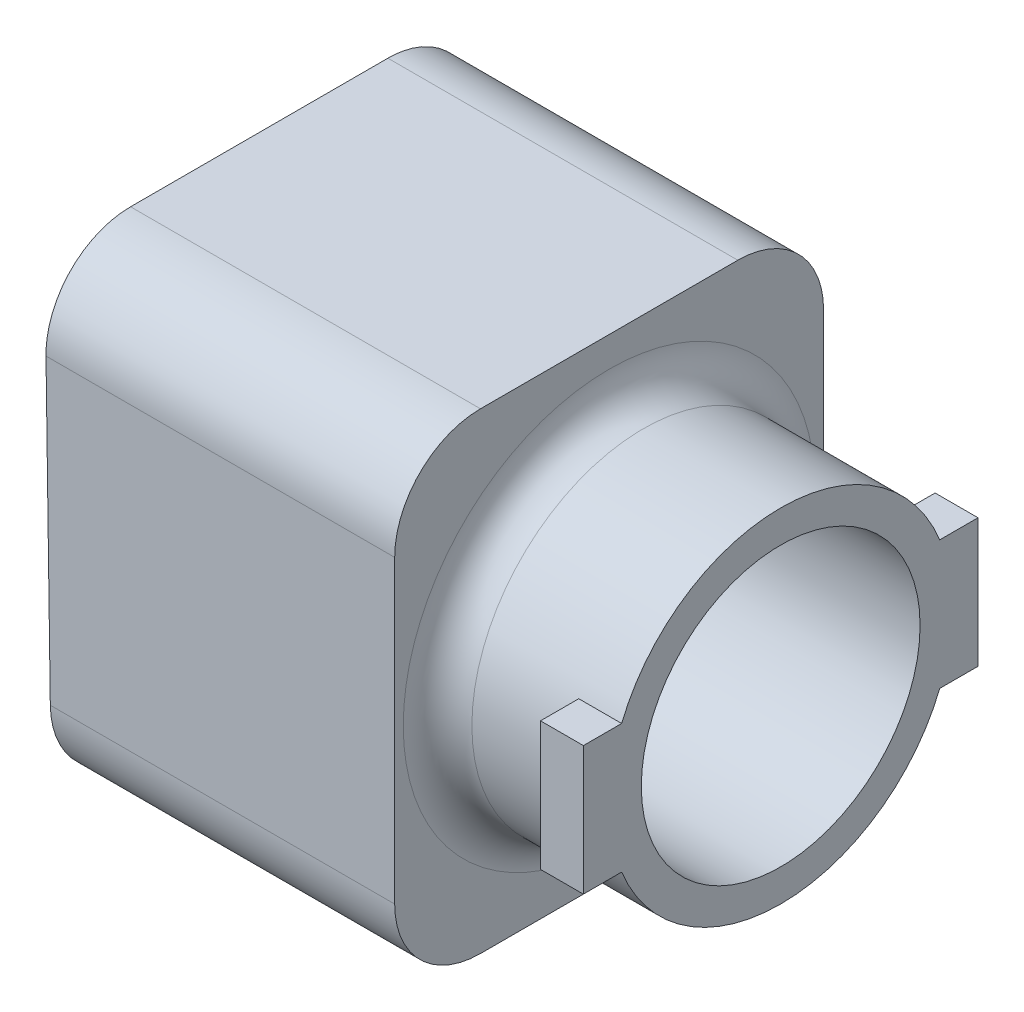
ISO-10303-21;
HEADER;
FILE_DESCRIPTION(('STEP AP214'),'2;1');
FILE_NAME('part.step','',(''),(''),'','','');
FILE_SCHEMA(('AUTOMOTIVE_DESIGN { 1 0 10303 214 1 1 1 1 }'));
ENDSEC;
DATA;
#1=APPLICATION_CONTEXT('core data for automotive mechanical design processes');
#2=APPLICATION_PROTOCOL_DEFINITION('international standard','automotive_design',2000,#1);
#3=PRODUCT_CONTEXT('',#1,'mechanical');
#4=PRODUCT('Part','Part','',(#3));
#5=PRODUCT_RELATED_PRODUCT_CATEGORY('part','',(#4));
#6=PRODUCT_DEFINITION_FORMATION('','',#4);
#7=PRODUCT_DEFINITION_CONTEXT('part definition',#1,'design');
#8=PRODUCT_DEFINITION('design','',#6,#7);
#9=PRODUCT_DEFINITION_SHAPE('','',#8);
#10=(LENGTH_UNIT() NAMED_UNIT(*) SI_UNIT(.MILLI.,.METRE.));
#11=(NAMED_UNIT(*) PLANE_ANGLE_UNIT() SI_UNIT($,.RADIAN.));
#12=(NAMED_UNIT(*) SI_UNIT($,.STERADIAN.) SOLID_ANGLE_UNIT());
#13=UNCERTAINTY_MEASURE_WITH_UNIT(LENGTH_MEASURE(1.E-05),#10,'distance_accuracy_value','');
#14=(GEOMETRIC_REPRESENTATION_CONTEXT(3) GLOBAL_UNCERTAINTY_ASSIGNED_CONTEXT((#13)) GLOBAL_UNIT_ASSIGNED_CONTEXT((#10,
#11,#12)) REPRESENTATION_CONTEXT('',''));
#15=CARTESIAN_POINT('',(0.,0.,0.));
#16=DIRECTION('',(0.,0.,1.));
#17=DIRECTION('',(1.,0.,0.));
#18=AXIS2_PLACEMENT_3D('',#15,#16,#17);
#19=CARTESIAN_POINT('',(93.696802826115,20.3973537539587,19.05));
#20=DIRECTION('',(0.0143574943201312,-0.999896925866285,0.));
#21=DIRECTION('',(0.999896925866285,0.0143574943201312,0.));
#22=AXIS2_PLACEMENT_3D('',#19,#20,#21);
#23=PLANE('',#22);
#24=DIRECTION('',(0.,0.,1.));
#25=VECTOR('',#24,1.);
#26=CARTESIAN_POINT('',(-0.2735102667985,19.0480364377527,19.05));
#27=LINE('',#26,#25);
#28=CARTESIAN_POINT('',(-0.2735102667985,19.0480364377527,44.45));
#29=VERTEX_POINT('',#28);
#30=CARTESIAN_POINT('',(-0.2735102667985,19.0480364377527,82.55));
#31=VERTEX_POINT('',#30);
#32=EDGE_CURVE('E328',#29,#31,#27,.T.);
#33=ORIENTED_EDGE('',*,*,#32,.T.);
#34=DIRECTION('',(-0.999896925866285,-0.0143574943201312,0.));
#35=VECTOR('',#34,1.);
#36=CARTESIAN_POINT('',(93.696802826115,20.3973537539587,82.55));
#37=LINE('',#36,#35);
#38=CARTESIAN_POINT('',(50.8,19.7813996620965,82.55));
#39=VERTEX_POINT('',#38);
#40=EDGE_CURVE('E438',#31,#39,#37,.F.);
#41=ORIENTED_EDGE('',*,*,#40,.T.);
#42=CARTESIAN_POINT('',(50.8,19.7813996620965,63.5));
#43=DIRECTION('',(0.0143574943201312,-0.999896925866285,0.));
#44=DIRECTION('',(-0.999896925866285,-0.0143574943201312,0.));
#45=AXIS2_PLACEMENT_3D('',#42,#43,#44);
#46=ELLIPSE('',#45,19.0519637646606,19.05);
#47=CARTESIAN_POINT('',(50.8,19.7813996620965,44.45));
#48=VERTEX_POINT('',#47);
#49=EDGE_CURVE('E292',#39,#48,#46,.T.);
#50=ORIENTED_EDGE('',*,*,#49,.T.);
#51=DIRECTION('',(-0.999896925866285,-0.0143574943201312,0.));
#52=VECTOR('',#51,1.);
#53=CARTESIAN_POINT('',(-0.273510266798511,19.0480364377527,44.45));
#54=LINE('',#53,#52);
#55=EDGE_CURVE('E428',#48,#29,#54,.T.);
#56=ORIENTED_EDGE('',*,*,#55,.T.);
#57=EDGE_LOOP('',(#33,#41,#50,#56));
#58=FACE_BOUND('',#57,.T.);
#59=ADVANCED_FACE('F41',(#58),#23,.F.);
#60=CARTESIAN_POINT('',(-2.18830769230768,152.4,127.));
#61=DIRECTION('',(0.999896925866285,0.0143574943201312,0.));
#62=DIRECTION('',(-0.0143574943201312,0.999896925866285,0.));
#63=AXIS2_PLACEMENT_3D('',#60,#61,#62);
#64=PLANE('',#63);
#65=ORIENTED_EDGE('',*,*,#32,.F.);
#66=CARTESIAN_POINT('',(-0.638190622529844,44.4454183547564,44.45));
#67=DIRECTION('',(0.999896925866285,0.0143574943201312,0.));
#68=DIRECTION('',(-0.0143574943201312,0.999896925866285,0.));
#69=AXIS2_PLACEMENT_3D('',#66,#67,#68);
#70=CIRCLE('',#69,25.4);
#71=CARTESIAN_POINT('',(-0.638190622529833,44.4454183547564,19.05));
#72=VERTEX_POINT('',#71);
#73=EDGE_CURVE('E476',#29,#72,#70,.T.);
#74=ORIENTED_EDGE('',*,*,#73,.T.);
#75=DIRECTION('',(0.0143574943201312,-0.999896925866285,0.));
#76=VECTOR('',#75,1.);
#77=CARTESIAN_POINT('',(-1.73223168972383,120.637564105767,19.05));
#78=LINE('',#77,#76);
#79=CARTESIAN_POINT('',(-1.3675513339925,95.2401821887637,19.05));
#80=VERTEX_POINT('',#79);
#81=EDGE_CURVE('E306',#80,#72,#78,.T.);
#82=ORIENTED_EDGE('',*,*,#81,.F.);
#83=CARTESIAN_POINT('',(-1.36755133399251,95.2401821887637,44.45));
#84=DIRECTION('',(0.999896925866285,0.0143574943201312,0.));
#85=DIRECTION('',(-0.0143574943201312,0.999896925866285,0.));
#86=AXIS2_PLACEMENT_3D('',#83,#84,#85);
#87=CIRCLE('',#86,25.4);
#88=CARTESIAN_POINT('',(-1.73223168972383,120.637564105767,44.45));
#89=VERTEX_POINT('',#88);
#90=EDGE_CURVE('E473',#80,#89,#87,.T.);
#91=ORIENTED_EDGE('',*,*,#90,.T.);
#92=DIRECTION('',(0.,0.,-1.));
#93=VECTOR('',#92,1.);
#94=CARTESIAN_POINT('',(-1.73223168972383,120.637564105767,19.05));
#95=LINE('',#94,#93);
#96=CARTESIAN_POINT('',(-1.73223168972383,120.637564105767,82.55));
#97=VERTEX_POINT('',#96);
#98=EDGE_CURVE('E312',#97,#89,#95,.T.);
#99=ORIENTED_EDGE('',*,*,#98,.F.);
#100=CARTESIAN_POINT('',(-1.36755133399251,95.2401821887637,82.55));
#101=DIRECTION('',(0.999896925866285,0.0143574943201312,0.));
#102=DIRECTION('',(-0.0143574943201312,0.999896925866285,0.));
#103=AXIS2_PLACEMENT_3D('',#100,#101,#102);
#104=CIRCLE('',#103,25.4);
#105=CARTESIAN_POINT('',(-1.3675513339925,95.2401821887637,107.95));
#106=VERTEX_POINT('',#105);
#107=EDGE_CURVE('E470',#97,#106,#104,.T.);
#108=ORIENTED_EDGE('',*,*,#107,.T.);
#109=DIRECTION('',(-0.0143574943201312,0.999896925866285,0.));
#110=VECTOR('',#109,1.);
#111=CARTESIAN_POINT('',(-1.73223168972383,120.637564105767,107.95));
#112=LINE('',#111,#110);
#113=CARTESIAN_POINT('',(-0.638190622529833,44.4454183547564,107.95));
#114=VERTEX_POINT('',#113);
#115=EDGE_CURVE('E332',#114,#106,#112,.T.);
#116=ORIENTED_EDGE('',*,*,#115,.F.);
#117=CARTESIAN_POINT('',(-0.638190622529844,44.4454183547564,82.55));
#118=DIRECTION('',(0.999896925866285,0.0143574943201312,0.));
#119=DIRECTION('',(-0.0143574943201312,0.999896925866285,0.));
#120=AXIS2_PLACEMENT_3D('',#117,#118,#119);
#121=CIRCLE('',#120,25.4);
#122=EDGE_CURVE('E467',#114,#31,#121,.T.);
#123=ORIENTED_EDGE('',*,*,#122,.T.);
#124=EDGE_LOOP('',(#65,#74,#82,#91,#99,#108,#116,#123));
#125=FACE_BOUND('',#124,.T.);
#126=DIRECTION('',(0.0143574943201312,-0.999896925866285,0.));
#127=VECTOR('',#126,1.);
#128=CARTESIAN_POINT('',(-2.18830769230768,152.4,0.));
#129=LINE('',#128,#127);
#130=CARTESIAN_POINT('',(-1.64123076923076,114.3,0.));
#131=VERTEX_POINT('',#130);
#132=CARTESIAN_POINT('',(-0.364717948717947,25.4,0.));
#133=VERTEX_POINT('',#132);
#134=EDGE_CURVE('E324',#131,#133,#129,.T.);
#135=ORIENTED_EDGE('',*,*,#134,.T.);
#136=CARTESIAN_POINT('',(-0.364717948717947,25.4,25.4));
#137=DIRECTION('',(0.999896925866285,0.0143574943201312,0.));
#138=DIRECTION('',(0.0143574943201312,-0.999896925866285,0.));
#139=AXIS2_PLACEMENT_3D('',#136,#137,#138);
#140=ELLIPSE('',#139,25.4026183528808,25.4);
#141=CARTESIAN_POINT('',(0.,0.,25.4));
#142=VERTEX_POINT('',#141);
#143=EDGE_CURVE('E404',#133,#142,#140,.F.);
#144=ORIENTED_EDGE('',*,*,#143,.T.);
#145=DIRECTION('',(0.,0.,-1.));
#146=VECTOR('',#145,1.);
#147=CARTESIAN_POINT('',(0.,0.,127.));
#148=LINE('',#147,#146);
#149=CARTESIAN_POINT('',(0.,0.,101.6));
#150=VERTEX_POINT('',#149);
#151=EDGE_CURVE('E362',#150,#142,#148,.T.);
#152=ORIENTED_EDGE('',*,*,#151,.F.);
#153=CARTESIAN_POINT('',(-0.364717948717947,25.4,101.6));
#154=DIRECTION('',(0.999896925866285,0.0143574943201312,0.));
#155=DIRECTION('',(-0.0143574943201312,0.999896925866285,0.));
#156=AXIS2_PLACEMENT_3D('',#153,#154,#155);
#157=ELLIPSE('',#156,25.4026183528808,25.4);
#158=CARTESIAN_POINT('',(-0.364717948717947,25.4,127.));
#159=VERTEX_POINT('',#158);
#160=EDGE_CURVE('E401',#150,#159,#157,.F.);
#161=ORIENTED_EDGE('',*,*,#160,.T.);
#162=DIRECTION('',(0.0143574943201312,-0.999896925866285,0.));
#163=VECTOR('',#162,1.);
#164=CARTESIAN_POINT('',(-2.18830769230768,152.4,127.));
#165=LINE('',#164,#163);
#166=CARTESIAN_POINT('',(-1.64123076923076,114.3,127.));
#167=VERTEX_POINT('',#166);
#168=EDGE_CURVE('E339',#167,#159,#165,.T.);
#169=ORIENTED_EDGE('',*,*,#168,.F.);
#170=CARTESIAN_POINT('',(-1.64123076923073,114.3,101.6));
#171=DIRECTION('',(0.999896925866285,0.0143574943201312,0.));
#172=DIRECTION('',(-0.0143574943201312,0.999896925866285,0.));
#173=AXIS2_PLACEMENT_3D('',#170,#171,#172);
#174=ELLIPSE('',#173,25.4026183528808,25.4);
#175=CARTESIAN_POINT('',(-2.00594871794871,139.7,101.6));
#176=VERTEX_POINT('',#175);
#177=EDGE_CURVE('E398',#167,#176,#174,.F.);
#178=ORIENTED_EDGE('',*,*,#177,.T.);
#179=DIRECTION('',(0.,0.,-1.));
#180=VECTOR('',#179,1.);
#181=CARTESIAN_POINT('',(-2.00594871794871,139.7,127.));
#182=LINE('',#181,#180);
#183=CARTESIAN_POINT('',(-2.00594871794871,139.7,25.4));
#184=VERTEX_POINT('',#183);
#185=EDGE_CURVE('E297',#176,#184,#182,.T.);
#186=ORIENTED_EDGE('',*,*,#185,.T.);
#187=CARTESIAN_POINT('',(-1.64123076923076,114.3,25.4));
#188=DIRECTION('',(0.999896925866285,0.0143574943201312,0.));
#189=DIRECTION('',(0.0143574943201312,-0.999896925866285,0.));
#190=AXIS2_PLACEMENT_3D('',#187,#188,#189);
#191=ELLIPSE('',#190,25.4026183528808,25.4);
#192=EDGE_CURVE('E395',#184,#131,#191,.F.);
#193=ORIENTED_EDGE('',*,*,#192,.T.);
#194=EDGE_LOOP('',(#135,#144,#152,#161,#169,#178,#186,#193));
#195=FACE_BOUND('',#194,.T.);
#196=ADVANCED_FACE('F520',(#125,#195),#64,.F.);
#197=CARTESIAN_POINT('',(0.,0.,127.));
#198=DIRECTION('',(0.,1.,0.));
#199=DIRECTION('',(0.,0.,1.));
#200=AXIS2_PLACEMENT_3D('',#197,#198,#199);
#201=PLANE('',#200);
#202=CARTESIAN_POINT('',(50.8,0.,63.5));
#203=DIRECTION('',(0.,-1.,0.));
#204=DIRECTION('',(0.,0.,-1.));
#205=AXIS2_PLACEMENT_3D('',#202,#203,#204);
#206=CIRCLE('',#205,25.4);
#207=CARTESIAN_POINT('',(50.8,0.,38.1));
#208=VERTEX_POINT('',#207);
#209=EDGE_CURVE('E298',#208,#208,#206,.T.);
#210=ORIENTED_EDGE('',*,*,#209,.F.);
#211=EDGE_LOOP('',(#210));
#212=FACE_BOUND('',#211,.T.);
#213=ORIENTED_EDGE('',*,*,#151,.T.);
#214=DIRECTION('',(1.,0.,0.));
#215=VECTOR('',#214,1.);
#216=CARTESIAN_POINT('',(0.,0.,25.4));
#217=LINE('',#216,#215);
#218=CARTESIAN_POINT('',(101.6,0.,25.4));
#219=VERTEX_POINT('',#218);
#220=EDGE_CURVE('E372',#142,#219,#217,.T.);
#221=ORIENTED_EDGE('',*,*,#220,.T.);
#222=DIRECTION('',(0.,0.,-1.));
#223=VECTOR('',#222,1.);
#224=CARTESIAN_POINT('',(101.6,0.,127.));
#225=LINE('',#224,#223);
#226=CARTESIAN_POINT('',(101.6,0.,101.6));
#227=VERTEX_POINT('',#226);
#228=EDGE_CURVE('E358',#227,#219,#225,.T.);
#229=ORIENTED_EDGE('',*,*,#228,.F.);
#230=DIRECTION('',(1.,0.,0.));
#231=VECTOR('',#230,1.);
#232=CARTESIAN_POINT('',(0.,0.,101.6));
#233=LINE('',#232,#231);
#234=EDGE_CURVE('E366',#227,#150,#233,.F.);
#235=ORIENTED_EDGE('',*,*,#234,.T.);
#236=EDGE_LOOP('',(#213,#221,#229,#235));
#237=FACE_BOUND('',#236,.T.);
#238=ADVANCED_FACE('F527',(#212,#237),#201,.F.);
#239=CARTESIAN_POINT('',(101.6,0.,127.));
#240=DIRECTION('',(-1.,0.,0.));
#241=DIRECTION('',(0.,0.,1.));
#242=AXIS2_PLACEMENT_3D('',#239,#240,#241);
#243=PLANE('',#242);
#244=CARTESIAN_POINT('',(101.6,69.85,63.5));
#245=DIRECTION('',(-1.,0.,0.));
#246=DIRECTION('',(0.,0.,1.));
#247=AXIS2_PLACEMENT_3D('',#244,#245,#246);
#248=CIRCLE('',#247,60.96);
#249=CARTESIAN_POINT('',(101.6,69.85,124.46));
#250=VERTEX_POINT('',#249);
#251=EDGE_CURVE('E482',#250,#250,#248,.T.);
#252=ORIENTED_EDGE('',*,*,#251,.T.);
#253=EDGE_LOOP('',(#252));
#254=FACE_BOUND('',#253,.T.);
#255=ORIENTED_EDGE('',*,*,#228,.T.);
#256=CARTESIAN_POINT('',(101.6,25.4,25.4));
#257=DIRECTION('',(-1.,0.,0.));
#258=DIRECTION('',(0.,0.,1.));
#259=AXIS2_PLACEMENT_3D('',#256,#257,#258);
#260=CIRCLE('',#259,25.4);
#261=CARTESIAN_POINT('',(101.6,25.4,0.));
#262=VERTEX_POINT('',#261);
#263=EDGE_CURVE('E385',#219,#262,#260,.F.);
#264=ORIENTED_EDGE('',*,*,#263,.T.);
#265=DIRECTION('',(0.,1.,0.));
#266=VECTOR('',#265,1.);
#267=CARTESIAN_POINT('',(101.6,0.,0.));
#268=LINE('',#267,#266);
#269=CARTESIAN_POINT('',(101.6,114.3,0.));
#270=VERTEX_POINT('',#269);
#271=EDGE_CURVE('E344',#262,#270,#268,.T.);
#272=ORIENTED_EDGE('',*,*,#271,.T.);
#273=CARTESIAN_POINT('',(101.6,114.3,25.4));
#274=DIRECTION('',(-1.,0.,0.));
#275=DIRECTION('',(0.,0.,1.));
#276=AXIS2_PLACEMENT_3D('',#273,#274,#275);
#277=CIRCLE('',#276,25.4);
#278=CARTESIAN_POINT('',(101.6,139.7,25.4));
#279=VERTEX_POINT('',#278);
#280=EDGE_CURVE('E376',#270,#279,#277,.F.);
#281=ORIENTED_EDGE('',*,*,#280,.T.);
#282=DIRECTION('',(0.,0.,-1.));
#283=VECTOR('',#282,1.);
#284=CARTESIAN_POINT('',(101.6,139.7,127.));
#285=LINE('',#284,#283);
#286=CARTESIAN_POINT('',(101.6,139.7,101.6));
#287=VERTEX_POINT('',#286);
#288=EDGE_CURVE('E348',#287,#279,#285,.T.);
#289=ORIENTED_EDGE('',*,*,#288,.F.);
#290=CARTESIAN_POINT('',(101.6,114.3,101.6));
#291=DIRECTION('',(-1.,0.,0.));
#292=DIRECTION('',(0.,0.,1.));
#293=AXIS2_PLACEMENT_3D('',#290,#291,#292);
#294=CIRCLE('',#293,25.4);
#295=CARTESIAN_POINT('',(101.6,114.3,127.));
#296=VERTEX_POINT('',#295);
#297=EDGE_CURVE('E379',#287,#296,#294,.F.);
#298=ORIENTED_EDGE('',*,*,#297,.T.);
#299=DIRECTION('',(0.,1.,0.));
#300=VECTOR('',#299,1.);
#301=CARTESIAN_POINT('',(101.6,0.,127.));
#302=LINE('',#301,#300);
#303=CARTESIAN_POINT('',(101.6,25.4,127.));
#304=VERTEX_POINT('',#303);
#305=EDGE_CURVE('E343',#304,#296,#302,.T.);
#306=ORIENTED_EDGE('',*,*,#305,.F.);
#307=CARTESIAN_POINT('',(101.6,25.4,101.6));
#308=DIRECTION('',(-1.,0.,0.));
#309=DIRECTION('',(0.,0.,1.));
#310=AXIS2_PLACEMENT_3D('',#307,#308,#309);
#311=CIRCLE('',#310,25.4);
#312=EDGE_CURVE('E382',#304,#227,#311,.F.);
#313=ORIENTED_EDGE('',*,*,#312,.T.);
#314=EDGE_LOOP('',(#255,#264,#272,#281,#289,#298,#306,#313));
#315=FACE_BOUND('',#314,.T.);
#316=ADVANCED_FACE('F598',(#254,#315),#243,.F.);
#317=CARTESIAN_POINT('',(0.,0.,127.));
#318=DIRECTION('',(0.,0.,1.));
#319=DIRECTION('',(1.,0.,0.));
#320=AXIS2_PLACEMENT_3D('',#317,#318,#319);
#321=PLANE('',#320);
#322=ORIENTED_EDGE('',*,*,#168,.T.);
#323=DIRECTION('',(1.,0.,0.));
#324=VECTOR('',#323,1.);
#325=CARTESIAN_POINT('',(101.6,25.4,127.));
#326=LINE('',#325,#324);
#327=EDGE_CURVE('E410',#159,#304,#326,.T.);
#328=ORIENTED_EDGE('',*,*,#327,.T.);
#329=ORIENTED_EDGE('',*,*,#305,.T.);
#330=DIRECTION('',(1.,0.,0.));
#331=VECTOR('',#330,1.);
#332=CARTESIAN_POINT('',(-2.00594871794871,114.3,127.));
#333=LINE('',#332,#331);
#334=EDGE_CURVE('E407',#296,#167,#333,.F.);
#335=ORIENTED_EDGE('',*,*,#334,.T.);
#336=EDGE_LOOP('',(#322,#328,#329,#335));
#337=FACE_BOUND('',#336,.T.);
#338=ADVANCED_FACE('F606',(#337),#321,.T.);
#339=CARTESIAN_POINT('',(0.,0.,0.));
#340=DIRECTION('',(0.,0.,1.));
#341=DIRECTION('',(1.,0.,0.));
#342=AXIS2_PLACEMENT_3D('',#339,#340,#341);
#343=PLANE('',#342);
#344=ORIENTED_EDGE('',*,*,#271,.F.);
#345=DIRECTION('',(1.,0.,0.));
#346=VECTOR('',#345,1.);
#347=CARTESIAN_POINT('',(0.,25.4,0.));
#348=LINE('',#347,#346);
#349=EDGE_CURVE('E392',#262,#133,#348,.F.);
#350=ORIENTED_EDGE('',*,*,#349,.T.);
#351=ORIENTED_EDGE('',*,*,#134,.F.);
#352=DIRECTION('',(1.,0.,0.));
#353=VECTOR('',#352,1.);
#354=CARTESIAN_POINT('',(0.,114.3,0.));
#355=LINE('',#354,#353);
#356=EDGE_CURVE('E388',#131,#270,#355,.T.);
#357=ORIENTED_EDGE('',*,*,#356,.T.);
#358=EDGE_LOOP('',(#344,#350,#351,#357));
#359=FACE_BOUND('',#358,.T.);
#360=ADVANCED_FACE('F619',(#359),#343,.F.);
#361=CARTESIAN_POINT('',(92.2380814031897,121.986881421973,19.05));
#362=DIRECTION('',(0.,0.,-1.));
#363=DIRECTION('',(0.,1.,0.));
#364=AXIS2_PLACEMENT_3D('',#361,#362,#363);
#365=PLANE('',#364);
#366=DIRECTION('',(0.0143574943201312,-0.999896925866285,0.));
#367=VECTOR('',#366,1.);
#368=CARTESIAN_POINT('',(92.2380814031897,121.986881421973,19.05));
#369=LINE('',#368,#367);
#370=CARTESIAN_POINT('',(92.602761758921,96.5894995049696,19.05));
#371=VERTEX_POINT('',#370);
#372=CARTESIAN_POINT('',(93.3321224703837,45.7947356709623,19.05));
#373=VERTEX_POINT('',#372);
#374=EDGE_CURVE('E307',#371,#373,#369,.T.);
#375=ORIENTED_EDGE('',*,*,#374,.F.);
#376=DIRECTION('',(-0.999896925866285,-0.0143574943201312,0.));
#377=VECTOR('',#376,1.);
#378=CARTESIAN_POINT('',(-1.36755133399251,95.2401821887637,19.05));
#379=LINE('',#378,#377);
#380=EDGE_CURVE('E463',#371,#80,#379,.T.);
#381=ORIENTED_EDGE('',*,*,#380,.T.);
#382=ORIENTED_EDGE('',*,*,#81,.T.);
#383=DIRECTION('',(-0.999896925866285,-0.0143574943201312,0.));
#384=VECTOR('',#383,1.);
#385=CARTESIAN_POINT('',(93.3321224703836,45.7947356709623,19.05));
#386=LINE('',#385,#384);
#387=EDGE_CURVE('E460',#72,#373,#386,.F.);
#388=ORIENTED_EDGE('',*,*,#387,.T.);
#389=EDGE_LOOP('',(#375,#381,#382,#388));
#390=FACE_BOUND('',#389,.T.);
#391=ADVANCED_FACE('F576',(#390),#365,.F.);
#392=CARTESIAN_POINT('',(92.2380814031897,121.986881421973,19.05));
#393=DIRECTION('',(-0.0143574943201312,0.999896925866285,0.));
#394=DIRECTION('',(-0.999896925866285,-0.0143574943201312,0.));
#395=AXIS2_PLACEMENT_3D('',#392,#393,#394);
#396=PLANE('',#395);
#397=DIRECTION('',(0.,0.,-1.));
#398=VECTOR('',#397,1.);
#399=CARTESIAN_POINT('',(92.2380814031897,121.986881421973,19.05));
#400=LINE('',#399,#398);
#401=CARTESIAN_POINT('',(92.2380814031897,121.986881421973,82.55));
#402=VERTEX_POINT('',#401);
#403=CARTESIAN_POINT('',(92.2380814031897,121.986881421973,44.45));
#404=VERTEX_POINT('',#403);
#405=EDGE_CURVE('E320',#402,#404,#400,.T.);
#406=ORIENTED_EDGE('',*,*,#405,.F.);
#407=DIRECTION('',(-0.999896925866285,-0.0143574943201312,0.));
#408=VECTOR('',#407,1.);
#409=CARTESIAN_POINT('',(-1.73223168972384,120.637564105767,82.55));
#410=LINE('',#409,#408);
#411=EDGE_CURVE('E456',#402,#97,#410,.T.);
#412=ORIENTED_EDGE('',*,*,#411,.T.);
#413=ORIENTED_EDGE('',*,*,#98,.T.);
#414=DIRECTION('',(-0.999896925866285,-0.0143574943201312,0.));
#415=VECTOR('',#414,1.);
#416=CARTESIAN_POINT('',(92.2380814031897,121.986881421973,44.45));
#417=LINE('',#416,#415);
#418=EDGE_CURVE('E453',#89,#404,#417,.F.);
#419=ORIENTED_EDGE('',*,*,#418,.T.);
#420=EDGE_LOOP('',(#406,#412,#413,#419));
#421=FACE_BOUND('',#420,.T.);
#422=ADVANCED_FACE('F543',(#421),#396,.F.);
#423=CARTESIAN_POINT('',(92.2380814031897,121.986881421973,107.95));
#424=DIRECTION('',(0.,0.,1.));
#425=DIRECTION('',(0.,-1.,0.));
#426=AXIS2_PLACEMENT_3D('',#423,#424,#425);
#427=PLANE('',#426);
#428=DIRECTION('',(-0.0143574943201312,0.999896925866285,0.));
#429=VECTOR('',#428,1.);
#430=CARTESIAN_POINT('',(92.2380814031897,121.986881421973,107.95));
#431=LINE('',#430,#429);
#432=CARTESIAN_POINT('',(93.3321224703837,45.7947356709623,107.95));
#433=VERTEX_POINT('',#432);
#434=CARTESIAN_POINT('',(92.602761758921,96.5894995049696,107.95));
#435=VERTEX_POINT('',#434);
#436=EDGE_CURVE('E316',#433,#435,#431,.T.);
#437=ORIENTED_EDGE('',*,*,#436,.F.);
#438=DIRECTION('',(-0.999896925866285,-0.0143574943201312,0.));
#439=VECTOR('',#438,1.);
#440=CARTESIAN_POINT('',(-0.638190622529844,44.4454183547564,107.95));
#441=LINE('',#440,#439);
#442=EDGE_CURVE('E424',#433,#114,#441,.T.);
#443=ORIENTED_EDGE('',*,*,#442,.T.);
#444=ORIENTED_EDGE('',*,*,#115,.T.);
#445=DIRECTION('',(-0.999896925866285,-0.0143574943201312,0.));
#446=VECTOR('',#445,1.);
#447=CARTESIAN_POINT('',(92.602761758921,96.5894995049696,107.95));
#448=LINE('',#447,#446);
#449=EDGE_CURVE('E421',#106,#435,#448,.F.);
#450=ORIENTED_EDGE('',*,*,#449,.T.);
#451=EDGE_LOOP('',(#437,#443,#444,#450));
#452=FACE_BOUND('',#451,.T.);
#453=ADVANCED_FACE('F534',(#452),#427,.F.);
#454=EDGE_CURVE('E302',#48,#39,#46,.T.);
#455=ORIENTED_EDGE('',*,*,#454,.T.);
#456=DIRECTION('',(-0.999896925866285,-0.0143574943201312,0.));
#457=VECTOR('',#456,1.);
#458=CARTESIAN_POINT('',(93.696802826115,20.3973537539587,82.55));
#459=LINE('',#458,#457);
#460=CARTESIAN_POINT('',(93.696802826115,20.3973537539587,82.55));
#461=VERTEX_POINT('',#460);
#462=EDGE_CURVE('E435',#39,#461,#459,.F.);
#463=ORIENTED_EDGE('',*,*,#462,.T.);
#464=DIRECTION('',(0.,0.,1.));
#465=VECTOR('',#464,1.);
#466=CARTESIAN_POINT('',(93.696802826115,20.3973537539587,19.05));
#467=LINE('',#466,#465);
#468=CARTESIAN_POINT('',(93.696802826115,20.3973537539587,44.45));
#469=VERTEX_POINT('',#468);
#470=EDGE_CURVE('E311',#469,#461,#467,.T.);
#471=ORIENTED_EDGE('',*,*,#470,.F.);
#472=DIRECTION('',(-0.999896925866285,-0.0143574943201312,0.));
#473=VECTOR('',#472,1.);
#474=CARTESIAN_POINT('',(-0.273510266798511,19.0480364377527,44.45));
#475=LINE('',#474,#473);
#476=EDGE_CURVE('E431',#469,#48,#475,.T.);
#477=ORIENTED_EDGE('',*,*,#476,.T.);
#478=EDGE_LOOP('',(#455,#463,#471,#477));
#479=FACE_BOUND('',#478,.T.);
#480=ADVANCED_FACE('F523',(#479),#23,.F.);
#481=CARTESIAN_POINT('',(93.9703130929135,1.34931731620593,0.));
#482=DIRECTION('',(-0.999896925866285,-0.0143574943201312,0.));
#483=DIRECTION('',(0.0143574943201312,-0.999896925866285,0.));
#484=AXIS2_PLACEMENT_3D('',#481,#482,#483);
#485=PLANE('',#484);
#486=CARTESIAN_POINT('',(92.9867135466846,69.85,63.5));
#487=DIRECTION('',(-0.999896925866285,-0.0143574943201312,0.));
#488=DIRECTION('',(0.0143574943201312,-0.999896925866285,0.));
#489=AXIS2_PLACEMENT_3D('',#486,#487,#488);
#490=ELLIPSE('',#489,41.2792548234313,41.275);
#491=CARTESIAN_POINT('',(93.5793802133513,28.575,63.5));
#492=VERTEX_POINT('',#491);
#493=EDGE_CURVE('E242',#492,#492,#490,.T.);
#494=ORIENTED_EDGE('',*,*,#493,.F.);
#495=EDGE_LOOP('',(#494));
#496=FACE_BOUND('',#495,.T.);
#497=ORIENTED_EDGE('',*,*,#470,.T.);
#498=CARTESIAN_POINT('',(93.3321224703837,45.7947356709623,82.55));
#499=DIRECTION('',(-0.999896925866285,-0.0143574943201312,0.));
#500=DIRECTION('',(0.0143574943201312,-0.999896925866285,0.));
#501=AXIS2_PLACEMENT_3D('',#498,#499,#500);
#502=CIRCLE('',#501,25.4);
#503=EDGE_CURVE('E450',#461,#433,#502,.T.);
#504=ORIENTED_EDGE('',*,*,#503,.T.);
#505=ORIENTED_EDGE('',*,*,#436,.T.);
#506=CARTESIAN_POINT('',(92.602761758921,96.5894995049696,82.55));
#507=DIRECTION('',(-0.999896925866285,-0.0143574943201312,0.));
#508=DIRECTION('',(0.0143574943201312,-0.999896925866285,0.));
#509=AXIS2_PLACEMENT_3D('',#506,#507,#508);
#510=CIRCLE('',#509,25.4);
#511=EDGE_CURVE('E447',#435,#402,#510,.T.);
#512=ORIENTED_EDGE('',*,*,#511,.T.);
#513=ORIENTED_EDGE('',*,*,#405,.T.);
#514=CARTESIAN_POINT('',(92.602761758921,96.5894995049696,44.45));
#515=DIRECTION('',(-0.999896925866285,-0.0143574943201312,0.));
#516=DIRECTION('',(0.0143574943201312,-0.999896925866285,0.));
#517=AXIS2_PLACEMENT_3D('',#514,#515,#516);
#518=CIRCLE('',#517,25.4);
#519=EDGE_CURVE('E444',#404,#371,#518,.T.);
#520=ORIENTED_EDGE('',*,*,#519,.T.);
#521=ORIENTED_EDGE('',*,*,#374,.T.);
#522=CARTESIAN_POINT('',(93.3321224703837,45.7947356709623,44.45));
#523=DIRECTION('',(-0.999896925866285,-0.0143574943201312,0.));
#524=DIRECTION('',(0.0143574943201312,-0.999896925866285,0.));
#525=AXIS2_PLACEMENT_3D('',#522,#523,#524);
#526=CIRCLE('',#525,25.4);
#527=EDGE_CURVE('E441',#373,#469,#526,.T.);
#528=ORIENTED_EDGE('',*,*,#527,.T.);
#529=EDGE_LOOP('',(#497,#504,#505,#512,#513,#520,#521,#528));
#530=FACE_BOUND('',#529,.T.);
#531=ADVANCED_FACE('F533',(#496,#530),#485,.T.);
#532=CARTESIAN_POINT('',(-222.25,139.7,127.));
#533=DIRECTION('',(0.,-1.,0.));
#534=DIRECTION('',(0.,0.,-1.));
#535=AXIS2_PLACEMENT_3D('',#532,#533,#534);
#536=PLANE('',#535);
#537=ORIENTED_EDGE('',*,*,#185,.F.);
#538=DIRECTION('',(1.,0.,0.));
#539=VECTOR('',#538,1.);
#540=CARTESIAN_POINT('',(101.6,139.7,101.6));
#541=LINE('',#540,#539);
#542=EDGE_CURVE('E417',#176,#287,#541,.T.);
#543=ORIENTED_EDGE('',*,*,#542,.T.);
#544=ORIENTED_EDGE('',*,*,#288,.T.);
#545=DIRECTION('',(1.,0.,0.));
#546=VECTOR('',#545,1.);
#547=CARTESIAN_POINT('',(-222.25,139.7,25.4));
#548=LINE('',#547,#546);
#549=EDGE_CURVE('E414',#279,#184,#548,.F.);
#550=ORIENTED_EDGE('',*,*,#549,.T.);
#551=EDGE_LOOP('',(#537,#543,#544,#550));
#552=FACE_BOUND('',#551,.T.);
#553=ADVANCED_FACE('F540',(#552),#536,.F.);
#554=CARTESIAN_POINT('',(50.8,8.89,63.5));
#555=DIRECTION('',(0.,-1.,0.));
#556=DIRECTION('',(0.,0.,-1.));
#557=AXIS2_PLACEMENT_3D('',#554,#555,#556);
#558=CYLINDRICAL_SURFACE('',#557,25.4);
#559=CARTESIAN_POINT('',(50.8,8.89,63.5));
#560=DIRECTION('',(0.,-1.,0.));
#561=DIRECTION('',(0.,0.,-1.));
#562=AXIS2_PLACEMENT_3D('',#559,#560,#561);
#563=CIRCLE('',#562,25.4);
#564=CARTESIAN_POINT('',(50.8,8.89,38.1));
#565=VERTEX_POINT('',#564);
#566=EDGE_CURVE('E293',#565,#565,#563,.T.);
#567=ORIENTED_EDGE('',*,*,#566,.F.);
#568=EDGE_LOOP('',(#567));
#569=FACE_BOUND('',#568,.T.);
#570=ORIENTED_EDGE('',*,*,#209,.T.);
#571=EDGE_LOOP('',(#570));
#572=FACE_BOUND('',#571,.T.);
#573=ADVANCED_FACE('F665',(#569,#572),#558,.F.);
#574=CARTESIAN_POINT('',(50.8,8.89,63.5));
#575=DIRECTION('',(0.,-1.,0.));
#576=DIRECTION('',(0.,0.,-1.));
#577=AXIS2_PLACEMENT_3D('',#574,#575,#576);
#578=PLANE('',#577);
#579=CARTESIAN_POINT('',(50.8,8.89,63.5));
#580=DIRECTION('',(0.,-1.,0.));
#581=DIRECTION('',(0.,0.,-1.));
#582=AXIS2_PLACEMENT_3D('',#579,#580,#581);
#583=CIRCLE('',#582,19.05);
#584=CARTESIAN_POINT('',(50.8,8.89,44.45));
#585=VERTEX_POINT('',#584);
#586=EDGE_CURVE('E288',#585,#585,#583,.T.);
#587=ORIENTED_EDGE('',*,*,#586,.F.);
#588=EDGE_LOOP('',(#587));
#589=FACE_BOUND('',#588,.T.);
#590=ORIENTED_EDGE('',*,*,#566,.T.);
#591=EDGE_LOOP('',(#590));
#592=FACE_BOUND('',#591,.T.);
#593=ADVANCED_FACE('F661',(#589,#592),#578,.T.);
#594=CARTESIAN_POINT('',(50.8,34.29,63.5));
#595=DIRECTION('',(0.,-1.,0.));
#596=DIRECTION('',(0.,0.,-1.));
#597=AXIS2_PLACEMENT_3D('',#594,#595,#596);
#598=CYLINDRICAL_SURFACE('',#597,19.05);
#599=ORIENTED_EDGE('',*,*,#586,.T.);
#600=EDGE_LOOP('',(#599));
#601=FACE_BOUND('',#600,.T.);
#602=ORIENTED_EDGE('',*,*,#454,.F.);
#603=ORIENTED_EDGE('',*,*,#49,.F.);
#604=EDGE_LOOP('',(#602,#603));
#605=FACE_BOUND('',#604,.T.);
#606=ADVANCED_FACE('F635',(#601,#605),#598,.F.);
#607=CARTESIAN_POINT('',(0.,25.4,25.4));
#608=DIRECTION('',(1.,0.,0.));
#609=DIRECTION('',(0.,0.,-1.));
#610=AXIS2_PLACEMENT_3D('',#607,#608,#609);
#611=CYLINDRICAL_SURFACE('',#610,25.4);
#612=ORIENTED_EDGE('',*,*,#143,.F.);
#613=ORIENTED_EDGE('',*,*,#349,.F.);
#614=ORIENTED_EDGE('',*,*,#263,.F.);
#615=ORIENTED_EDGE('',*,*,#220,.F.);
#616=EDGE_LOOP('',(#612,#613,#614,#615));
#617=FACE_BOUND('',#616,.T.);
#618=ADVANCED_FACE('F593',(#617),#611,.T.);
#619=CARTESIAN_POINT('',(0.,25.4,101.6));
#620=DIRECTION('',(-1.,0.,0.));
#621=DIRECTION('',(0.,0.,1.));
#622=AXIS2_PLACEMENT_3D('',#619,#620,#621);
#623=CYLINDRICAL_SURFACE('',#622,25.4);
#624=ORIENTED_EDGE('',*,*,#160,.F.);
#625=ORIENTED_EDGE('',*,*,#234,.F.);
#626=ORIENTED_EDGE('',*,*,#312,.F.);
#627=ORIENTED_EDGE('',*,*,#327,.F.);
#628=EDGE_LOOP('',(#624,#625,#626,#627));
#629=FACE_BOUND('',#628,.T.);
#630=ADVANCED_FACE('F604',(#629),#623,.T.);
#631=CARTESIAN_POINT('',(-222.25,114.3,101.6));
#632=DIRECTION('',(-1.,0.,0.));
#633=DIRECTION('',(0.,0.,1.));
#634=AXIS2_PLACEMENT_3D('',#631,#632,#633);
#635=CYLINDRICAL_SURFACE('',#634,25.4);
#636=ORIENTED_EDGE('',*,*,#177,.F.);
#637=ORIENTED_EDGE('',*,*,#334,.F.);
#638=ORIENTED_EDGE('',*,*,#297,.F.);
#639=ORIENTED_EDGE('',*,*,#542,.F.);
#640=EDGE_LOOP('',(#636,#637,#638,#639));
#641=FACE_BOUND('',#640,.T.);
#642=ADVANCED_FACE('F613',(#641),#635,.T.);
#643=CARTESIAN_POINT('',(0.,114.3,25.4));
#644=DIRECTION('',(1.,0.,0.));
#645=DIRECTION('',(0.,0.,-1.));
#646=AXIS2_PLACEMENT_3D('',#643,#644,#645);
#647=CYLINDRICAL_SURFACE('',#646,25.4);
#648=ORIENTED_EDGE('',*,*,#192,.F.);
#649=ORIENTED_EDGE('',*,*,#549,.F.);
#650=ORIENTED_EDGE('',*,*,#280,.F.);
#651=ORIENTED_EDGE('',*,*,#356,.F.);
#652=EDGE_LOOP('',(#648,#649,#650,#651));
#653=FACE_BOUND('',#652,.T.);
#654=ADVANCED_FACE('F618',(#653),#647,.T.);
#655=CARTESIAN_POINT('',(93.3321224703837,45.7947356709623,82.55));
#656=DIRECTION('',(0.999896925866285,0.0143574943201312,0.));
#657=DIRECTION('',(-0.0143574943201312,0.999896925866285,0.));
#658=AXIS2_PLACEMENT_3D('',#655,#656,#657);
#659=CYLINDRICAL_SURFACE('',#658,25.4);
#660=ORIENTED_EDGE('',*,*,#462,.F.);
#661=ORIENTED_EDGE('',*,*,#40,.F.);
#662=ORIENTED_EDGE('',*,*,#122,.F.);
#663=ORIENTED_EDGE('',*,*,#442,.F.);
#664=ORIENTED_EDGE('',*,*,#503,.F.);
#665=EDGE_LOOP('',(#660,#661,#662,#663,#664));
#666=FACE_BOUND('',#665,.T.);
#667=ADVANCED_FACE('F555',(#666),#659,.F.);
#668=CARTESIAN_POINT('',(92.602761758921,96.5894995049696,82.55));
#669=DIRECTION('',(0.999896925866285,0.0143574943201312,0.));
#670=DIRECTION('',(-0.0143574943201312,0.999896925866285,0.));
#671=AXIS2_PLACEMENT_3D('',#668,#669,#670);
#672=CYLINDRICAL_SURFACE('',#671,25.4);
#673=ORIENTED_EDGE('',*,*,#511,.F.);
#674=ORIENTED_EDGE('',*,*,#449,.F.);
#675=ORIENTED_EDGE('',*,*,#107,.F.);
#676=ORIENTED_EDGE('',*,*,#411,.F.);
#677=EDGE_LOOP('',(#673,#674,#675,#676));
#678=FACE_BOUND('',#677,.T.);
#679=ADVANCED_FACE('F563',(#678),#672,.F.);
#680=CARTESIAN_POINT('',(92.602761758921,96.5894995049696,44.45));
#681=DIRECTION('',(0.999896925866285,0.0143574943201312,0.));
#682=DIRECTION('',(-0.0143574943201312,0.999896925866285,0.));
#683=AXIS2_PLACEMENT_3D('',#680,#681,#682);
#684=CYLINDRICAL_SURFACE('',#683,25.4);
#685=ORIENTED_EDGE('',*,*,#519,.F.);
#686=ORIENTED_EDGE('',*,*,#418,.F.);
#687=ORIENTED_EDGE('',*,*,#90,.F.);
#688=ORIENTED_EDGE('',*,*,#380,.F.);
#689=EDGE_LOOP('',(#685,#686,#687,#688));
#690=FACE_BOUND('',#689,.T.);
#691=ADVANCED_FACE('F571',(#690),#684,.F.);
#692=CARTESIAN_POINT('',(93.3321224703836,45.7947356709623,44.45));
#693=DIRECTION('',(0.999896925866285,0.0143574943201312,0.));
#694=DIRECTION('',(-0.0143574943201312,0.999896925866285,0.));
#695=AXIS2_PLACEMENT_3D('',#692,#693,#694);
#696=CYLINDRICAL_SURFACE('',#695,25.4);
#697=ORIENTED_EDGE('',*,*,#527,.F.);
#698=ORIENTED_EDGE('',*,*,#387,.F.);
#699=ORIENTED_EDGE('',*,*,#73,.F.);
#700=ORIENTED_EDGE('',*,*,#55,.F.);
#701=ORIENTED_EDGE('',*,*,#476,.F.);
#702=EDGE_LOOP('',(#697,#698,#699,#700,#701));
#703=FACE_BOUND('',#702,.T.);
#704=ADVANCED_FACE('F581',(#703),#696,.F.);
#705=CARTESIAN_POINT('',(152.4,69.85,63.5));
#706=DIRECTION('',(-1.,0.,0.));
#707=DIRECTION('',(0.,0.,1.));
#708=AXIS2_PLACEMENT_3D('',#705,#706,#707);
#709=CYLINDRICAL_SURFACE('',#708,50.8);
#710=CARTESIAN_POINT('',(111.76,69.85,63.5));
#711=DIRECTION('',(-1.,0.,0.));
#712=DIRECTION('',(0.,0.,1.));
#713=AXIS2_PLACEMENT_3D('',#710,#711,#712);
#714=CIRCLE('',#713,50.8);
#715=CARTESIAN_POINT('',(111.76,69.85,114.3));
#716=VERTEX_POINT('',#715);
#717=EDGE_CURVE('E479',#716,#716,#714,.F.);
#718=ORIENTED_EDGE('',*,*,#717,.T.);
#719=EDGE_LOOP('',(#718));
#720=FACE_BOUND('',#719,.T.);
#721=CARTESIAN_POINT('',(139.7,69.85,63.5));
#722=DIRECTION('',(-1.,0.,0.));
#723=DIRECTION('',(0.,0.,1.));
#724=AXIS2_PLACEMENT_3D('',#721,#722,#723);
#725=CIRCLE('',#724,50.8);
#726=CARTESIAN_POINT('',(139.7,88.9,16.4071396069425));
#727=VERTEX_POINT('',#726);
#728=CARTESIAN_POINT('',(139.7,50.8,16.4071396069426));
#729=VERTEX_POINT('',#728);
#730=EDGE_CURVE('E11',#727,#729,#725,.T.);
#731=ORIENTED_EDGE('',*,*,#730,.T.);
#732=DIRECTION('',(-1.,0.,0.));
#733=VECTOR('',#732,1.);
#734=CARTESIAN_POINT('',(152.4,50.8,16.4071396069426));
#735=LINE('',#734,#733);
#736=CARTESIAN_POINT('',(152.4,50.8,16.4071396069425));
#737=VERTEX_POINT('',#736);
#738=EDGE_CURVE('E276',#729,#737,#735,.F.);
#739=ORIENTED_EDGE('',*,*,#738,.T.);
#740=CARTESIAN_POINT('',(152.4,69.85,63.5));
#741=DIRECTION('',(1.,0.,0.));
#742=DIRECTION('',(0.,0.,-1.));
#743=AXIS2_PLACEMENT_3D('',#740,#741,#742);
#744=CIRCLE('',#743,50.8);
#745=CARTESIAN_POINT('',(152.4,50.8,110.592860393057));
#746=VERTEX_POINT('',#745);
#747=EDGE_CURVE('E284',#746,#737,#744,.T.);
#748=ORIENTED_EDGE('',*,*,#747,.F.);
#749=DIRECTION('',(-1.,0.,0.));
#750=VECTOR('',#749,1.);
#751=CARTESIAN_POINT('',(152.4,50.8,110.592860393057));
#752=LINE('',#751,#750);
#753=CARTESIAN_POINT('',(139.7,50.8,110.592860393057));
#754=VERTEX_POINT('',#753);
#755=EDGE_CURVE('E280',#746,#754,#752,.T.);
#756=ORIENTED_EDGE('',*,*,#755,.T.);
#757=CARTESIAN_POINT('',(139.7,88.9,110.592860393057));
#758=VERTEX_POINT('',#757);
#759=EDGE_CURVE('E45',#754,#758,#725,.T.);
#760=ORIENTED_EDGE('',*,*,#759,.T.);
#761=DIRECTION('',(-1.,0.,0.));
#762=VECTOR('',#761,1.);
#763=CARTESIAN_POINT('',(152.4,88.9,110.592860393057));
#764=LINE('',#763,#762);
#765=CARTESIAN_POINT('',(152.4,88.9,110.592860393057));
#766=VERTEX_POINT('',#765);
#767=EDGE_CURVE('E263',#758,#766,#764,.F.);
#768=ORIENTED_EDGE('',*,*,#767,.T.);
#769=CARTESIAN_POINT('',(152.4,88.9,16.4071396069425));
#770=VERTEX_POINT('',#769);
#771=EDGE_CURVE('E285',#770,#766,#744,.T.);
#772=ORIENTED_EDGE('',*,*,#771,.F.);
#773=DIRECTION('',(-1.,0.,0.));
#774=VECTOR('',#773,1.);
#775=CARTESIAN_POINT('',(152.4,88.9,16.4071396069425));
#776=LINE('',#775,#774);
#777=EDGE_CURVE('E212',#770,#727,#776,.T.);
#778=ORIENTED_EDGE('',*,*,#777,.T.);
#779=EDGE_LOOP('',(#731,#739,#748,#756,#760,#768,#772,#778));
#780=FACE_BOUND('',#779,.T.);
#781=ADVANCED_FACE('F490',(#720,#780),#709,.T.);
#782=CARTESIAN_POINT('',(152.4,69.85,63.5));
#783=DIRECTION('',(1.,0.,0.));
#784=DIRECTION('',(0.,0.,-1.));
#785=AXIS2_PLACEMENT_3D('',#782,#783,#784);
#786=PLANE('',#785);
#787=CARTESIAN_POINT('',(152.4,69.85,63.5));
#788=DIRECTION('',(1.,0.,0.));
#789=DIRECTION('',(0.,0.,-1.));
#790=AXIS2_PLACEMENT_3D('',#787,#788,#789);
#791=CIRCLE('',#790,41.275);
#792=CARTESIAN_POINT('',(152.4,69.85,22.225));
#793=VERTEX_POINT('',#792);
#794=EDGE_CURVE('E824',#793,#793,#791,.T.);
#795=ORIENTED_EDGE('',*,*,#794,.F.);
#796=EDGE_LOOP('',(#795));
#797=FACE_BOUND('',#796,.T.);
#798=ORIENTED_EDGE('',*,*,#771,.T.);
#799=DIRECTION('',(0.,0.,1.));
#800=VECTOR('',#799,1.);
#801=CARTESIAN_POINT('',(152.4,88.9,5.07999999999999));
#802=LINE('',#801,#800);
#803=CARTESIAN_POINT('',(152.4,88.9,121.92));
#804=VERTEX_POINT('',#803);
#805=EDGE_CURVE('E65',#766,#804,#802,.T.);
#806=ORIENTED_EDGE('',*,*,#805,.T.);
#807=DIRECTION('',(0.,1.,0.));
#808=VECTOR('',#807,1.);
#809=CARTESIAN_POINT('',(152.4,88.9,121.92));
#810=LINE('',#809,#808);
#811=CARTESIAN_POINT('',(152.4,50.8,121.92));
#812=VERTEX_POINT('',#811);
#813=EDGE_CURVE('E250',#812,#804,#810,.T.);
#814=ORIENTED_EDGE('',*,*,#813,.F.);
#815=DIRECTION('',(0.,0.,1.));
#816=VECTOR('',#815,1.);
#817=CARTESIAN_POINT('',(152.4,50.8,5.07999999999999));
#818=LINE('',#817,#816);
#819=EDGE_CURVE('E264',#746,#812,#818,.T.);
#820=ORIENTED_EDGE('',*,*,#819,.F.);
#821=ORIENTED_EDGE('',*,*,#747,.T.);
#822=CARTESIAN_POINT('',(152.4,50.8,5.07999999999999));
#823=VERTEX_POINT('',#822);
#824=EDGE_CURVE('E233',#823,#737,#818,.T.);
#825=ORIENTED_EDGE('',*,*,#824,.F.);
#826=DIRECTION('',(0.,1.,0.));
#827=VECTOR('',#826,1.);
#828=CARTESIAN_POINT('',(152.4,88.9,5.07999999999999));
#829=LINE('',#828,#827);
#830=CARTESIAN_POINT('',(152.4,88.9,5.07999999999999));
#831=VERTEX_POINT('',#830);
#832=EDGE_CURVE('E225',#823,#831,#829,.T.);
#833=ORIENTED_EDGE('',*,*,#832,.T.);
#834=EDGE_CURVE('E207',#831,#770,#802,.T.);
#835=ORIENTED_EDGE('',*,*,#834,.T.);
#836=EDGE_LOOP('',(#798,#806,#814,#820,#821,#825,#833,#835));
#837=FACE_BOUND('',#836,.T.);
#838=ADVANCED_FACE('F231',(#797,#837),#786,.T.);
#839=CARTESIAN_POINT('',(111.76,69.85,63.5));
#840=DIRECTION('',(-1.,0.,0.));
#841=DIRECTION('',(0.,0.,1.));
#842=AXIS2_PLACEMENT_3D('',#839,#840,#841);
#843=TOROIDAL_SURFACE('',#842,60.96,10.16);
#844=ORIENTED_EDGE('',*,*,#251,.F.);
#845=EDGE_LOOP('',(#844));
#846=FACE_BOUND('',#845,.T.);
#847=ORIENTED_EDGE('',*,*,#717,.F.);
#848=EDGE_LOOP('',(#847));
#849=FACE_BOUND('',#848,.T.);
#850=ADVANCED_FACE('F43',(#846,#849),#843,.F.);
#851=CARTESIAN_POINT('',(0.,0.,121.92));
#852=DIRECTION('',(0.,0.,-1.));
#853=DIRECTION('',(-1.,0.,0.));
#854=AXIS2_PLACEMENT_3D('',#851,#852,#853);
#855=PLANE('',#854);
#856=ORIENTED_EDGE('',*,*,#813,.T.);
#857=DIRECTION('',(-1.,0.,0.));
#858=VECTOR('',#857,1.);
#859=CARTESIAN_POINT('',(152.4,88.9,121.92));
#860=LINE('',#859,#858);
#861=CARTESIAN_POINT('',(139.7,88.9,121.92));
#862=VERTEX_POINT('',#861);
#863=EDGE_CURVE('E254',#804,#862,#860,.T.);
#864=ORIENTED_EDGE('',*,*,#863,.T.);
#865=DIRECTION('',(0.,-1.,0.));
#866=VECTOR('',#865,1.);
#867=CARTESIAN_POINT('',(139.7,88.9,121.92));
#868=LINE('',#867,#866);
#869=CARTESIAN_POINT('',(139.7,50.8,121.92));
#870=VERTEX_POINT('',#869);
#871=EDGE_CURVE('E239',#862,#870,#868,.T.);
#872=ORIENTED_EDGE('',*,*,#871,.T.);
#873=DIRECTION('',(1.,0.,0.));
#874=VECTOR('',#873,1.);
#875=CARTESIAN_POINT('',(152.4,50.8,121.92));
#876=LINE('',#875,#874);
#877=EDGE_CURVE('E235',#870,#812,#876,.T.);
#878=ORIENTED_EDGE('',*,*,#877,.T.);
#879=EDGE_LOOP('',(#856,#864,#872,#878));
#880=FACE_BOUND('',#879,.T.);
#881=ADVANCED_FACE('F508',(#880),#855,.F.);
#882=CARTESIAN_POINT('',(152.4,88.9,5.07999999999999));
#883=DIRECTION('',(0.,1.,0.));
#884=DIRECTION('',(0.,0.,1.));
#885=AXIS2_PLACEMENT_3D('',#882,#883,#884);
#886=PLANE('',#885);
#887=ORIENTED_EDGE('',*,*,#767,.F.);
#888=DIRECTION('',(0.,0.,1.));
#889=VECTOR('',#888,1.);
#890=CARTESIAN_POINT('',(139.7,88.9,5.07999999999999));
#891=LINE('',#890,#889);
#892=EDGE_CURVE('E218',#758,#862,#891,.T.);
#893=ORIENTED_EDGE('',*,*,#892,.T.);
#894=ORIENTED_EDGE('',*,*,#863,.F.);
#895=ORIENTED_EDGE('',*,*,#805,.F.);
#896=EDGE_LOOP('',(#887,#893,#894,#895));
#897=FACE_BOUND('',#896,.T.);
#898=ADVANCED_FACE('F506',(#897),#886,.T.);
#899=CARTESIAN_POINT('',(139.7,88.9,5.07999999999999));
#900=DIRECTION('',(-1.,0.,0.));
#901=DIRECTION('',(0.,0.,1.));
#902=AXIS2_PLACEMENT_3D('',#899,#900,#901);
#903=PLANE('',#902);
#904=ORIENTED_EDGE('',*,*,#759,.F.);
#905=DIRECTION('',(0.,0.,1.));
#906=VECTOR('',#905,1.);
#907=CARTESIAN_POINT('',(139.7,50.8,5.07999999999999));
#908=LINE('',#907,#906);
#909=EDGE_CURVE('E269',#754,#870,#908,.T.);
#910=ORIENTED_EDGE('',*,*,#909,.T.);
#911=ORIENTED_EDGE('',*,*,#871,.F.);
#912=ORIENTED_EDGE('',*,*,#892,.F.);
#913=EDGE_LOOP('',(#904,#910,#911,#912));
#914=FACE_BOUND('',#913,.T.);
#915=ADVANCED_FACE('F495',(#914),#903,.T.);
#916=CARTESIAN_POINT('',(152.4,50.8,5.07999999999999));
#917=DIRECTION('',(0.,-1.,0.));
#918=DIRECTION('',(0.,0.,-1.));
#919=AXIS2_PLACEMENT_3D('',#916,#917,#918);
#920=PLANE('',#919);
#921=ORIENTED_EDGE('',*,*,#755,.F.);
#922=ORIENTED_EDGE('',*,*,#819,.T.);
#923=ORIENTED_EDGE('',*,*,#877,.F.);
#924=ORIENTED_EDGE('',*,*,#909,.F.);
#925=EDGE_LOOP('',(#921,#922,#923,#924));
#926=FACE_BOUND('',#925,.T.);
#927=ADVANCED_FACE('F499',(#926),#920,.T.);
#928=ORIENTED_EDGE('',*,*,#730,.F.);
#929=CARTESIAN_POINT('',(139.7,88.9,5.07999999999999));
#930=VERTEX_POINT('',#929);
#931=EDGE_CURVE('E57',#930,#727,#891,.T.);
#932=ORIENTED_EDGE('',*,*,#931,.F.);
#933=DIRECTION('',(0.,-1.,0.));
#934=VECTOR('',#933,1.);
#935=CARTESIAN_POINT('',(139.7,88.9,5.07999999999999));
#936=LINE('',#935,#934);
#937=CARTESIAN_POINT('',(139.7,50.8,5.07999999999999));
#938=VERTEX_POINT('',#937);
#939=EDGE_CURVE('E228',#930,#938,#936,.T.);
#940=ORIENTED_EDGE('',*,*,#939,.T.);
#941=EDGE_CURVE('E265',#938,#729,#908,.T.);
#942=ORIENTED_EDGE('',*,*,#941,.T.);
#943=EDGE_LOOP('',(#928,#932,#940,#942));
#944=FACE_BOUND('',#943,.T.);
#945=ADVANCED_FACE('F757',(#944),#903,.T.);
#946=ORIENTED_EDGE('',*,*,#738,.F.);
#947=ORIENTED_EDGE('',*,*,#941,.F.);
#948=DIRECTION('',(1.,0.,0.));
#949=VECTOR('',#948,1.);
#950=CARTESIAN_POINT('',(152.4,50.8,5.07999999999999));
#951=LINE('',#950,#949);
#952=EDGE_CURVE('E247',#938,#823,#951,.T.);
#953=ORIENTED_EDGE('',*,*,#952,.T.);
#954=ORIENTED_EDGE('',*,*,#824,.T.);
#955=EDGE_LOOP('',(#946,#947,#953,#954));
#956=FACE_BOUND('',#955,.T.);
#957=ADVANCED_FACE('F765',(#956),#920,.T.);
#958=ORIENTED_EDGE('',*,*,#777,.F.);
#959=ORIENTED_EDGE('',*,*,#834,.F.);
#960=DIRECTION('',(-1.,0.,0.));
#961=VECTOR('',#960,1.);
#962=CARTESIAN_POINT('',(152.4,88.9,5.07999999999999));
#963=LINE('',#962,#961);
#964=EDGE_CURVE('E210',#831,#930,#963,.T.);
#965=ORIENTED_EDGE('',*,*,#964,.T.);
#966=ORIENTED_EDGE('',*,*,#931,.T.);
#967=EDGE_LOOP('',(#958,#959,#965,#966));
#968=FACE_BOUND('',#967,.T.);
#969=ADVANCED_FACE('F209',(#968),#886,.T.);
#970=CARTESIAN_POINT('',(0.,0.,5.07999999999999));
#971=DIRECTION('',(0.,0.,-1.));
#972=DIRECTION('',(-1.,0.,0.));
#973=AXIS2_PLACEMENT_3D('',#970,#971,#972);
#974=PLANE('',#973);
#975=ORIENTED_EDGE('',*,*,#832,.F.);
#976=ORIENTED_EDGE('',*,*,#952,.F.);
#977=ORIENTED_EDGE('',*,*,#939,.F.);
#978=ORIENTED_EDGE('',*,*,#964,.F.);
#979=EDGE_LOOP('',(#975,#976,#977,#978));
#980=FACE_BOUND('',#979,.T.);
#981=ADVANCED_FACE('F223',(#980),#974,.T.);
#982=CARTESIAN_POINT('',(78.74,69.85,63.5));
#983=DIRECTION('',(1.,0.,0.));
#984=DIRECTION('',(0.,0.,-1.));
#985=AXIS2_PLACEMENT_3D('',#982,#983,#984);
#986=CYLINDRICAL_SURFACE('',#985,41.275);
#987=ORIENTED_EDGE('',*,*,#493,.T.);
#988=EDGE_LOOP('',(#987));
#989=FACE_BOUND('',#988,.T.);
#990=ORIENTED_EDGE('',*,*,#794,.T.);
#991=EDGE_LOOP('',(#990));
#992=FACE_BOUND('',#991,.T.);
#993=ADVANCED_FACE('F796',(#989,#992),#986,.F.);
#994=CLOSED_SHELL('',(#59,#196,#238,#316,#338,#360,#391,#422,#453,#480,#531,#553,#573,#593,#606,
#618,#630,#642,#654,#667,#679,#691,#704,#781,#838,#850,#881,#898,#915,#927,#945,#957,#969,#981,#993));
#995=MANIFOLD_SOLID_BREP('B2',#994);
#996=ADVANCED_BREP_SHAPE_REPRESENTATION('',(#18,#995),#14);
#997=SHAPE_DEFINITION_REPRESENTATION(#9,#996);
ENDSEC;
END-ISO-10303-21;
